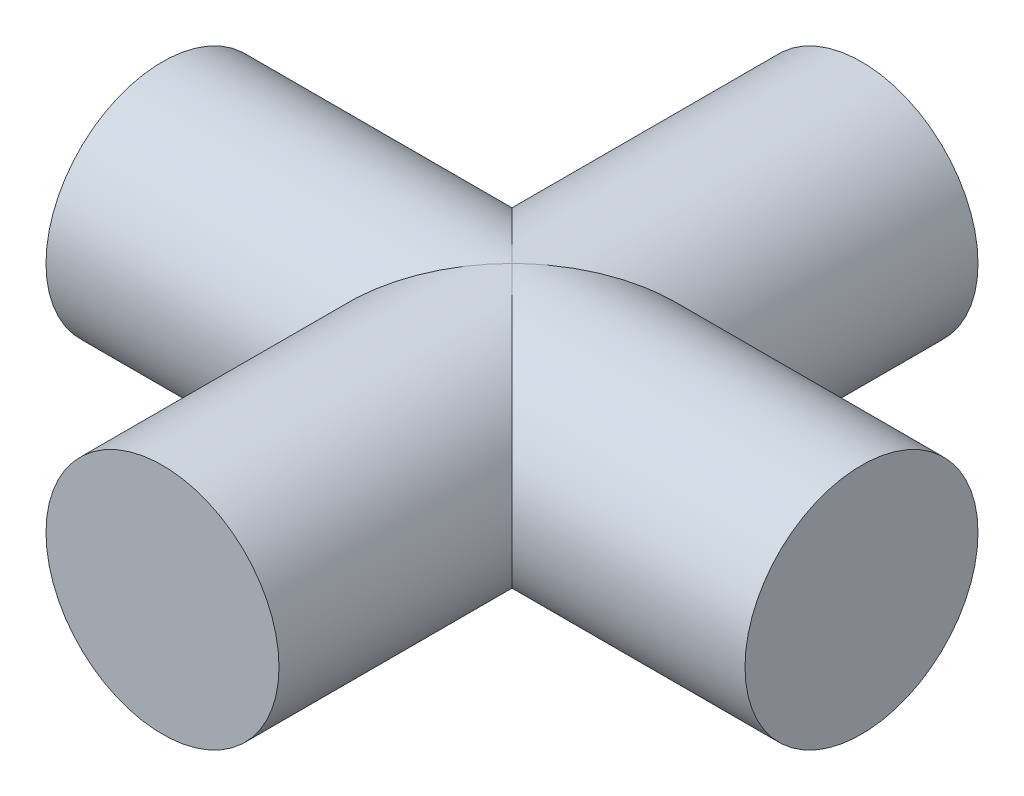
from build123d import *

# Parameters (mm, degrees)
BOSS_EXTRUDE1_DEPTH      = 19.05
BOSS_EXTRUDE1_DEPTH_BACK = 19.05
SKETCH1_R                = 6.35
BOSS_EXTRUDE2_DEPTH      = 19.05
BOSS_EXTRUDE2_DEPTH_BACK = 19.05
SKETCH2_R                = 6.35


with BuildPart() as part:
    # Sketch1 → Boss-Extrude1 (new, two sides: drawn at the far end of the back side and taken through both)
    with BuildSketch(Plane(origin=(0, 0, 0), x_dir=(0, 0, -1), z_dir=(1, 0, 0)).offset(-BOSS_EXTRUDE1_DEPTH_BACK)):
        Circle(SKETCH1_R)
    extrude(amount=BOSS_EXTRUDE1_DEPTH + BOSS_EXTRUDE1_DEPTH_BACK)

    # Sketch2 → Boss-Extrude2 (add, two sides: drawn at the far end of the back side and taken through both)
    with BuildSketch(Plane.XY.offset(-BOSS_EXTRUDE2_DEPTH_BACK)):
        Circle(SKETCH2_R)
    extrude(amount=BOSS_EXTRUDE2_DEPTH + BOSS_EXTRUDE2_DEPTH_BACK)


solid = part.part
